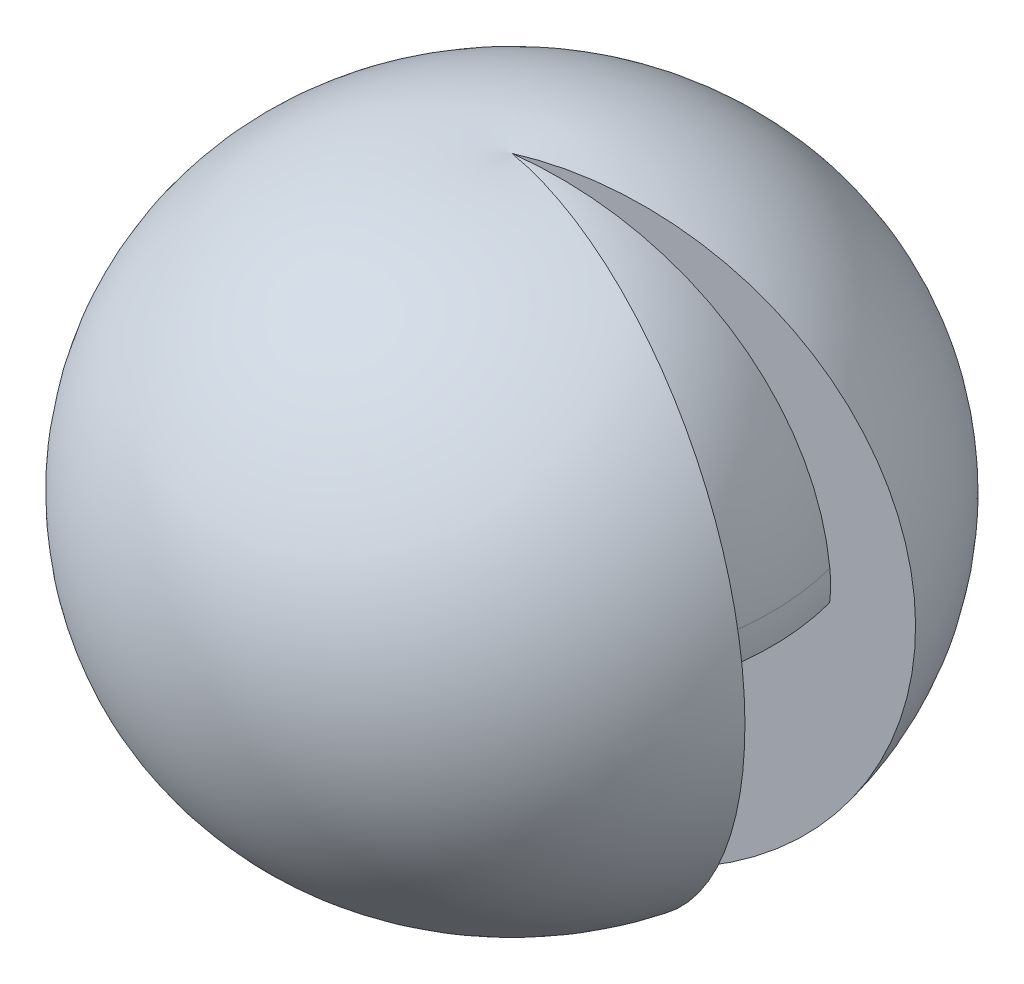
ISO-10303-21;
HEADER;
FILE_DESCRIPTION(('STEP AP214'),'2;1');
FILE_NAME('part.step','',(''),(''),'','','');
FILE_SCHEMA(('AUTOMOTIVE_DESIGN { 1 0 10303 214 1 1 1 1 }'));
ENDSEC;
DATA;
#1=APPLICATION_CONTEXT('core data for automotive mechanical design processes');
#2=APPLICATION_PROTOCOL_DEFINITION('international standard','automotive_design',2000,#1);
#3=PRODUCT_CONTEXT('',#1,'mechanical');
#4=PRODUCT('Part','Part','',(#3));
#5=PRODUCT_RELATED_PRODUCT_CATEGORY('part','',(#4));
#6=PRODUCT_DEFINITION_FORMATION('','',#4);
#7=PRODUCT_DEFINITION_CONTEXT('part definition',#1,'design');
#8=PRODUCT_DEFINITION('design','',#6,#7);
#9=PRODUCT_DEFINITION_SHAPE('','',#8);
#10=(LENGTH_UNIT() NAMED_UNIT(*) SI_UNIT(.MILLI.,.METRE.));
#11=(NAMED_UNIT(*) PLANE_ANGLE_UNIT() SI_UNIT($,.RADIAN.));
#12=(NAMED_UNIT(*) SI_UNIT($,.STERADIAN.) SOLID_ANGLE_UNIT());
#13=UNCERTAINTY_MEASURE_WITH_UNIT(LENGTH_MEASURE(1.E-05),#10,'distance_accuracy_value','');
#14=(GEOMETRIC_REPRESENTATION_CONTEXT(3) GLOBAL_UNCERTAINTY_ASSIGNED_CONTEXT((#13)) GLOBAL_UNIT_ASSIGNED_CONTEXT((#10,
#11,#12)) REPRESENTATION_CONTEXT('',''));
#15=CARTESIAN_POINT('',(0.,0.,0.));
#16=DIRECTION('',(0.,0.,1.));
#17=DIRECTION('',(1.,0.,0.));
#18=AXIS2_PLACEMENT_3D('',#15,#16,#17);
#19=CARTESIAN_POINT('',(0.,-104.721594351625,-399.344774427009));
#20=DIRECTION('',(-1.,0.,0.));
#21=DIRECTION('',(0.,0.,-1.));
#22=AXIS2_PLACEMENT_3D('',#19,#20,#21);
#23=CIRCLE('',#22,696.244210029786);
#24=TRIMMED_CURVE('',#23,(PARAMETER_VALUE(-2.18165367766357)),
(PARAMETER_VALUE(2.18165367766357)),.T.,.PARAMETER.);
#25=CARTESIAN_POINT('',(0.,-104.721594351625,0.));
#26=DIRECTION('',(0.,-1.,0.));
#27=AXIS1_PLACEMENT('',#25,#26);
#28=SURFACE_OF_REVOLUTION('',#24,#27);
#29=CARTESIAN_POINT('',(385.737431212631,-104.721594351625,-103.358033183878));
#30=DIRECTION('',(-0.258819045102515,0.,-0.96592582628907));
#31=DIRECTION('',(-0.96592582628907,0.,0.258819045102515));
#32=AXIS2_PLACEMENT_3D('',#29,#30,#31);
#33=CIRCLE('',#32,696.244210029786);
#34=CARTESIAN_POINT('',(669.956776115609,-735.733143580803,-179.514377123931));
#35=VERTEX_POINT('',#34);
#36=CARTESIAN_POINT('',(0.,-675.054612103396,0.));
#37=VERTEX_POINT('',#36);
#38=EDGE_CURVE('E143',#35,#37,#33,.T.);
#39=ORIENTED_EDGE('',*,*,#38,.T.);
#40=CARTESIAN_POINT('',(385.737431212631,-104.721594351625,103.358033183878));
#41=DIRECTION('',(0.258819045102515,0.,-0.96592582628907));
#42=DIRECTION('',(-0.96592582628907,0.,-0.258819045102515));
#43=AXIS2_PLACEMENT_3D('',#40,#41,#42);
#44=CIRCLE('',#43,696.244210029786);
#45=CARTESIAN_POINT('',(669.956776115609,-735.733143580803,179.514377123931));
#46=VERTEX_POINT('',#45);
#47=EDGE_CURVE('E148',#46,#37,#44,.T.);
#48=ORIENTED_EDGE('',*,*,#47,.F.);
#49=CARTESIAN_POINT('',(0.,-735.733143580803,0.));
#50=DIRECTION('',(0.,-1.,0.));
#51=DIRECTION('',(0.,0.,-1.));
#52=AXIS2_PLACEMENT_3D('',#49,#50,#51);
#53=CIRCLE('',#52,693.590292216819);
#54=EDGE_CURVE('E63',#46,#35,#53,.T.);
#55=ORIENTED_EDGE('',*,*,#54,.T.);
#56=EDGE_LOOP('',(#39,#48,#55));
#57=FACE_BOUND('',#56,.T.);
#58=ADVANCED_FACE('F40',(#57),#28,.T.);
#59=CARTESIAN_POINT('',(0.,61.0430833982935,109.684552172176));
#60=DIRECTION('',(-1.,0.,0.));
#61=DIRECTION('',(0.,0.,-1.));
#62=AXIS2_PLACEMENT_3D('',#59,#60,#61);
#63=CIRCLE('',#62,483.007260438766);
#64=TRIMMED_CURVE('',#63,(PARAMETER_VALUE(-1.34171108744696)),
(PARAMETER_VALUE(1.34171108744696)),.T.,.PARAMETER.);
#65=CARTESIAN_POINT('',(0.,61.0430833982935,0.));
#66=DIRECTION('',(0.,-1.,0.));
#67=AXIS1_PLACEMENT('',#65,#66);
#68=SURFACE_OF_REVOLUTION('',#64,#67);
#69=CARTESIAN_POINT('',(0.,253.742616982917,0.));
#70=DIRECTION('',(0.,-1.,0.));
#71=DIRECTION('',(0.,0.,-1.));
#72=AXIS2_PLACEMENT_3D('',#69,#70,#71);
#73=CIRCLE('',#72,333.218262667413);
#74=CARTESIAN_POINT('',(321.86412570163,253.742616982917,86.2432325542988));
#75=VERTEX_POINT('',#74);
#76=CARTESIAN_POINT('',(321.86412570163,253.742616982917,-86.2432325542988));
#77=VERTEX_POINT('',#76);
#78=EDGE_CURVE('E145',#75,#77,#73,.T.);
#79=ORIENTED_EDGE('',*,*,#78,.F.);
#80=CARTESIAN_POINT('',(-105.947141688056,61.0430833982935,-28.3884510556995));
#81=DIRECTION('',(-0.258819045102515,0.,0.96592582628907));
#82=DIRECTION('',(-0.96592582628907,0.,-0.258819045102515));
#83=AXIS2_PLACEMENT_3D('',#80,#81,#82);
#84=CIRCLE('',#83,483.007260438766);
#85=CARTESIAN_POINT('',(0.,-409.345386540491,0.));
#86=VERTEX_POINT('',#85);
#87=EDGE_CURVE('E128',#86,#75,#84,.T.);
#88=ORIENTED_EDGE('',*,*,#87,.F.);
#89=CARTESIAN_POINT('',(-105.947141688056,61.0430833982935,28.3884510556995));
#90=DIRECTION('',(0.258819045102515,0.,0.96592582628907));
#91=DIRECTION('',(-0.96592582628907,0.,0.258819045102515));
#92=AXIS2_PLACEMENT_3D('',#89,#90,#91);
#93=CIRCLE('',#92,483.007260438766);
#94=EDGE_CURVE('E136',#86,#77,#93,.T.);
#95=ORIENTED_EDGE('',*,*,#94,.T.);
#96=EDGE_LOOP('',(#79,#88,#95));
#97=FACE_BOUND('',#96,.T.);
#98=ADVANCED_FACE('F42',(#97),#68,.F.);
#99=CARTESIAN_POINT('',(0.,430.,0.));
#100=DIRECTION('',(0.,-1.,0.));
#101=DIRECTION('',(0.,0.,-1.));
#102=AXIS2_PLACEMENT_3D('',#99,#100,#101);
#103=DEGENERATE_TOROIDAL_SURFACE('',#102,150.000000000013,254.235317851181,.T.);
#104=CARTESIAN_POINT('',(0.,670.54172701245,0.));
#105=DIRECTION('',(0.,-1.,0.));
#106=DIRECTION('',(0.,0.,-1.));
#107=AXIS2_PLACEMENT_3D('',#104,#105,#106);
#108=CIRCLE('',#107,232.312055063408);
#109=CARTESIAN_POINT('',(224.396213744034,670.54172701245,60.126784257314));
#110=VERTEX_POINT('',#109);
#111=CARTESIAN_POINT('',(224.396213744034,670.54172701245,-60.126784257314));
#112=VERTEX_POINT('',#111);
#113=EDGE_CURVE('E166',#110,#112,#108,.T.);
#114=ORIENTED_EDGE('',*,*,#113,.F.);
#115=CARTESIAN_POINT('',(144.888873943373,430.,38.8228567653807));
#116=DIRECTION('',(-0.258819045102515,0.,0.96592582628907));
#117=DIRECTION('',(-0.96592582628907,0.,-0.258819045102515));
#118=AXIS2_PLACEMENT_3D('',#115,#116,#117);
#119=CIRCLE('',#118,254.235317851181);
#120=EDGE_CURVE('E147',#75,#110,#119,.T.);
#121=ORIENTED_EDGE('',*,*,#120,.F.);
#122=ORIENTED_EDGE('',*,*,#78,.T.);
#123=CARTESIAN_POINT('',(144.888873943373,430.,-38.8228567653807));
#124=DIRECTION('',(0.258819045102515,0.,0.96592582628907));
#125=DIRECTION('',(-0.96592582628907,0.,0.258819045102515));
#126=AXIS2_PLACEMENT_3D('',#123,#124,#125);
#127=CIRCLE('',#126,254.235317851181);
#128=EDGE_CURVE('E140',#77,#112,#127,.T.);
#129=ORIENTED_EDGE('',*,*,#128,.T.);
#130=EDGE_LOOP('',(#114,#121,#122,#129));
#131=FACE_BOUND('',#130,.T.);
#132=ADVANCED_FACE('F234',(#131),#103,.F.);
#133=CARTESIAN_POINT('',(0.,481.421888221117,437.75487187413));
#134=DIRECTION('',(-1.,0.,0.));
#135=DIRECTION('',(0.,0.,-1.));
#136=AXIS2_PLACEMENT_3D('',#133,#134,#135);
#137=CIRCLE('',#136,696.244210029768);
#138=TRIMMED_CURVE('',#137,(PARAMETER_VALUE(-0.89086768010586)),
(PARAMETER_VALUE(0.89086768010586)),.T.,.PARAMETER.);
#139=CARTESIAN_POINT('',(0.,481.421888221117,0.));
#140=DIRECTION('',(0.,-1.,0.));
#141=AXIS1_PLACEMENT('',#139,#140);
#142=SURFACE_OF_REVOLUTION('',#138,#141);
#143=CARTESIAN_POINT('',(-422.838736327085,481.421888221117,113.299297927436));
#144=DIRECTION('',(0.258819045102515,0.,0.96592582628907));
#145=DIRECTION('',(-0.96592582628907,0.,0.258819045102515));
#146=AXIS2_PLACEMENT_3D('',#143,#144,#145);
#147=CIRCLE('',#146,696.244210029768);
#148=CARTESIAN_POINT('',(0.,1022.83362816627,0.));
#149=VERTEX_POINT('',#148);
#150=EDGE_CURVE('E196',#112,#149,#147,.T.);
#151=ORIENTED_EDGE('',*,*,#150,.T.);
#152=CARTESIAN_POINT('',(-422.838736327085,481.421888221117,-113.299297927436));
#153=DIRECTION('',(-0.258819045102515,0.,0.96592582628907));
#154=DIRECTION('',(-0.96592582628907,0.,-0.258819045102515));
#155=AXIS2_PLACEMENT_3D('',#152,#153,#154);
#156=CIRCLE('',#155,696.244210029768);
#157=EDGE_CURVE('E152',#110,#149,#156,.T.);
#158=ORIENTED_EDGE('',*,*,#157,.F.);
#159=ORIENTED_EDGE('',*,*,#113,.T.);
#160=EDGE_LOOP('',(#151,#158,#159));
#161=FACE_BOUND('',#160,.T.);
#162=ADVANCED_FACE('F240',(#161),#142,.F.);
#163=CARTESIAN_POINT('',(0.,430.,-150.000000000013));
#164=DIRECTION('',(-1.,0.,0.));
#165=DIRECTION('',(0.,0.,-1.));
#166=AXIS2_PLACEMENT_3D('',#163,#164,#165);
#167=CIRCLE('',#166,1286.24421002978);
#168=TRIMMED_CURVE('',#167,(PARAMETER_VALUE(-1.68768089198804)),
(PARAMETER_VALUE(1.68768089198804)),.T.,.PARAMETER.);
#169=CARTESIAN_POINT('',(0.,430.,0.));
#170=DIRECTION('',(0.,-1.,0.));
#171=AXIS1_PLACEMENT('',#169,#170);
#172=SURFACE_OF_REVOLUTION('',#168,#171);
#173=CARTESIAN_POINT('',(144.888873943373,430.,38.8228567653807));
#174=DIRECTION('',(0.258819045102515,0.,-0.96592582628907));
#175=DIRECTION('',(-0.96592582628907,0.,-0.258819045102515));
#176=AXIS2_PLACEMENT_3D('',#173,#174,#175);
#177=CIRCLE('',#176,1286.24421002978);
#178=CARTESIAN_POINT('',(0.,1707.46787350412,0.));
#179=VERTEX_POINT('',#178);
#180=EDGE_CURVE('E161',#179,#46,#177,.T.);
#181=ORIENTED_EDGE('',*,*,#180,.F.);
#182=CARTESIAN_POINT('',(144.888873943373,430.,-38.8228567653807));
#183=DIRECTION('',(-0.258819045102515,0.,-0.96592582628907));
#184=DIRECTION('',(-0.96592582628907,0.,0.258819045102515));
#185=AXIS2_PLACEMENT_3D('',#182,#183,#184);
#186=CIRCLE('',#185,1286.24421002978);
#187=EDGE_CURVE('E154',#179,#35,#186,.T.);
#188=ORIENTED_EDGE('',*,*,#187,.T.);
#189=ORIENTED_EDGE('',*,*,#54,.F.);
#190=EDGE_LOOP('',(#181,#188,#189));
#191=FACE_BOUND('',#190,.T.);
#192=ADVANCED_FACE('F194',(#191),#172,.T.);
#193=CARTESIAN_POINT('',(385.737431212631,-104.721594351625,103.358033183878));
#194=DIRECTION('',(0.258819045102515,0.,-0.96592582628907));
#195=DIRECTION('',(-0.96592582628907,0.,-0.258819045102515));
#196=AXIS2_PLACEMENT_3D('',#193,#194,#195);
#197=PLANE('',#196);
#198=CARTESIAN_POINT('',(105.947141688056,61.0430833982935,28.3884510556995));
#199=DIRECTION('',(0.258819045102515,0.,-0.96592582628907));
#200=DIRECTION('',(-0.96592582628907,0.,-0.258819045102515));
#201=AXIS2_PLACEMENT_3D('',#198,#199,#200);
#202=CIRCLE('',#201,483.007260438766);
#203=CARTESIAN_POINT('',(219.94325688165,-407.324178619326,58.9336180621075));
#204=VERTEX_POINT('',#203);
#205=EDGE_CURVE('E116',#86,#204,#202,.F.);
#206=ORIENTED_EDGE('',*,*,#205,.F.);
#207=ORIENTED_EDGE('',*,*,#87,.T.);
#208=ORIENTED_EDGE('',*,*,#120,.T.);
#209=ORIENTED_EDGE('',*,*,#157,.T.);
#210=CARTESIAN_POINT('',(422.838736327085,481.421888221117,113.299297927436));
#211=DIRECTION('',(0.258819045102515,0.,-0.96592582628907));
#212=DIRECTION('',(-0.96592582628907,0.,-0.258819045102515));
#213=AXIS2_PLACEMENT_3D('',#210,#211,#212);
#214=CIRCLE('',#213,696.244210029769);
#215=CARTESIAN_POINT('',(1070.07368639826,670.541727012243,286.725380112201));
#216=VERTEX_POINT('',#215);
#217=EDGE_CURVE('E205',#216,#149,#214,.F.);
#218=ORIENTED_EDGE('',*,*,#217,.F.);
#219=CARTESIAN_POINT('',(-144.888873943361,430.,-38.8228567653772));
#220=DIRECTION('',(0.258819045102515,0.,-0.96592582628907));
#221=DIRECTION('',(-0.96592582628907,0.,-0.258819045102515));
#222=AXIS2_PLACEMENT_3D('',#219,#220,#221);
#223=CIRCLE('',#222,1280.61547702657);
#224=CARTESIAN_POINT('',(1091.96204193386,411.531105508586,292.590347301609));
#225=VERTEX_POINT('',#224);
#226=EDGE_CURVE('E208',#225,#216,#223,.F.);
#227=ORIENTED_EDGE('',*,*,#226,.F.);
#228=CARTESIAN_POINT('',(422.838736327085,481.421888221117,113.299297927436));
#229=DIRECTION('',(0.258819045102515,0.,-0.96592582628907));
#230=DIRECTION('',(-0.96592582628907,0.,-0.258819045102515));
#231=AXIS2_PLACEMENT_3D('',#228,#229,#230);
#232=CIRCLE('',#231,696.244210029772);
#233=CARTESIAN_POINT('',(1092.79985755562,542.103569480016,292.814839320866));
#234=VERTEX_POINT('',#233);
#235=EDGE_CURVE('E189',#234,#225,#232,.T.);
#236=ORIENTED_EDGE('',*,*,#235,.F.);
#237=CARTESIAN_POINT('',(-144.888873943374,430.,-38.8228567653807));
#238=DIRECTION('',(0.258819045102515,0.,-0.96592582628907));
#239=DIRECTION('',(-0.96592582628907,0.,-0.258819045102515));
#240=AXIS2_PLACEMENT_3D('',#237,#238,#239);
#241=CIRCLE('',#240,1286.24421002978);
#242=EDGE_CURVE('E193',#179,#234,#241,.T.);
#243=ORIENTED_EDGE('',*,*,#242,.F.);
#244=ORIENTED_EDGE('',*,*,#180,.T.);
#245=ORIENTED_EDGE('',*,*,#47,.T.);
#246=CARTESIAN_POINT('',(-385.737431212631,-104.721594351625,-103.358033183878));
#247=DIRECTION('',(0.258819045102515,0.,-0.96592582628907));
#248=DIRECTION('',(-0.96592582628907,0.,-0.258819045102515));
#249=AXIS2_PLACEMENT_3D('',#246,#247,#248);
#250=CIRCLE('',#249,696.244210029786);
#251=EDGE_CURVE('E131',#204,#37,#250,.T.);
#252=ORIENTED_EDGE('',*,*,#251,.F.);
#253=EDGE_LOOP('',(#206,#207,#208,#209,#218,#227,#236,#243,#244,#245,#252));
#254=FACE_BOUND('',#253,.T.);
#255=ADVANCED_FACE('F125',(#254),#197,.T.);
#256=CARTESIAN_POINT('',(385.737431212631,-104.721594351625,-103.358033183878));
#257=DIRECTION('',(-0.258819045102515,0.,-0.96592582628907));
#258=DIRECTION('',(-0.96592582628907,0.,0.258819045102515));
#259=AXIS2_PLACEMENT_3D('',#256,#257,#258);
#260=PLANE('',#259);
#261=ORIENTED_EDGE('',*,*,#94,.F.);
#262=CARTESIAN_POINT('',(105.947141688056,61.0430833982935,-28.3884510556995));
#263=DIRECTION('',(-0.258819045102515,0.,-0.96592582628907));
#264=DIRECTION('',(-0.96592582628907,0.,0.258819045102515));
#265=AXIS2_PLACEMENT_3D('',#262,#263,#264);
#266=CIRCLE('',#265,483.007260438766);
#267=CARTESIAN_POINT('',(219.94325688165,-407.324178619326,-58.9336180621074));
#268=VERTEX_POINT('',#267);
#269=EDGE_CURVE('E11',#86,#268,#266,.F.);
#270=ORIENTED_EDGE('',*,*,#269,.T.);
#271=CARTESIAN_POINT('',(-385.737431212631,-104.721594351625,103.358033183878));
#272=DIRECTION('',(-0.258819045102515,0.,-0.96592582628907));
#273=DIRECTION('',(-0.96592582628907,0.,0.258819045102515));
#274=AXIS2_PLACEMENT_3D('',#271,#272,#273);
#275=CIRCLE('',#274,696.244210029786);
#276=EDGE_CURVE('E48',#268,#37,#275,.T.);
#277=ORIENTED_EDGE('',*,*,#276,.T.);
#278=ORIENTED_EDGE('',*,*,#38,.F.);
#279=ORIENTED_EDGE('',*,*,#187,.F.);
#280=CARTESIAN_POINT('',(-144.888873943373,430.,38.8228567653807));
#281=DIRECTION('',(-0.258819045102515,0.,-0.96592582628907));
#282=DIRECTION('',(-0.96592582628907,0.,0.258819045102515));
#283=AXIS2_PLACEMENT_3D('',#280,#281,#282);
#284=CIRCLE('',#283,1286.24421002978);
#285=CARTESIAN_POINT('',(1092.79985755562,542.103569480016,-292.814839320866));
#286=VERTEX_POINT('',#285);
#287=EDGE_CURVE('E181',#179,#286,#284,.T.);
#288=ORIENTED_EDGE('',*,*,#287,.T.);
#289=CARTESIAN_POINT('',(422.838736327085,481.421888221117,-113.299297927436));
#290=DIRECTION('',(-0.258819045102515,0.,-0.96592582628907));
#291=DIRECTION('',(-0.96592582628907,0.,0.258819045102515));
#292=AXIS2_PLACEMENT_3D('',#289,#290,#291);
#293=CIRCLE('',#292,696.244210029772);
#294=CARTESIAN_POINT('',(1091.96204193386,411.531105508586,-292.590347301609));
#295=VERTEX_POINT('',#294);
#296=EDGE_CURVE('E178',#286,#295,#293,.T.);
#297=ORIENTED_EDGE('',*,*,#296,.T.);
#298=CARTESIAN_POINT('',(-144.888873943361,430.,38.8228567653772));
#299=DIRECTION('',(-0.258819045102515,0.,-0.96592582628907));
#300=DIRECTION('',(-0.96592582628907,0.,0.258819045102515));
#301=AXIS2_PLACEMENT_3D('',#298,#299,#300);
#302=CIRCLE('',#301,1280.61547702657);
#303=CARTESIAN_POINT('',(1070.07368639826,670.541727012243,-286.725380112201));
#304=VERTEX_POINT('',#303);
#305=EDGE_CURVE('E170',#295,#304,#302,.F.);
#306=ORIENTED_EDGE('',*,*,#305,.T.);
#307=CARTESIAN_POINT('',(422.838736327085,481.421888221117,-113.299297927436));
#308=DIRECTION('',(-0.258819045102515,0.,-0.96592582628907));
#309=DIRECTION('',(-0.96592582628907,0.,0.258819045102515));
#310=AXIS2_PLACEMENT_3D('',#307,#308,#309);
#311=CIRCLE('',#310,696.244210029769);
#312=EDGE_CURVE('E174',#304,#149,#311,.F.);
#313=ORIENTED_EDGE('',*,*,#312,.T.);
#314=ORIENTED_EDGE('',*,*,#150,.F.);
#315=ORIENTED_EDGE('',*,*,#128,.F.);
#316=EDGE_LOOP('',(#261,#270,#277,#278,#279,#288,#297,#306,#313,#314,#315));
#317=FACE_BOUND('',#316,.T.);
#318=ADVANCED_FACE('F137',(#317),#260,.F.);
#319=CARTESIAN_POINT('',(0.,481.421888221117,0.));
#320=DIRECTION('',(0.,-1.,0.));
#321=DIRECTION('',(0.,0.,-1.));
#322=AXIS2_PLACEMENT_3D('',#319,#320,#321);
#323=DEGENERATE_TOROIDAL_SURFACE('',#322,437.75487187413,696.244210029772,.T.);
#324=CARTESIAN_POINT('',(0.,542.103569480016,0.));
#325=DIRECTION('',(0.,-1.,0.));
#326=DIRECTION('',(0.,0.,-1.));
#327=AXIS2_PLACEMENT_3D('',#324,#325,#326);
#328=CIRCLE('',#327,1131.34966248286);
#329=EDGE_CURVE('E210',#286,#234,#328,.T.);
#330=ORIENTED_EDGE('',*,*,#329,.T.);
#331=ORIENTED_EDGE('',*,*,#235,.T.);
#332=CARTESIAN_POINT('',(0.,411.531105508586,0.));
#333=DIRECTION('',(0.,-1.,0.));
#334=DIRECTION('',(0.,0.,-1.));
#335=AXIS2_PLACEMENT_3D('',#332,#333,#334);
#336=CIRCLE('',#335,1130.48229192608);
#337=EDGE_CURVE('E132',#295,#225,#336,.T.);
#338=ORIENTED_EDGE('',*,*,#337,.F.);
#339=ORIENTED_EDGE('',*,*,#296,.F.);
#340=EDGE_LOOP('',(#330,#331,#338,#339));
#341=FACE_BOUND('',#340,.T.);
#342=ADVANCED_FACE('F254',(#341),#323,.T.);
#343=CARTESIAN_POINT('',(0.,430.,150.000000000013));
#344=DIRECTION('',(-1.,0.,0.));
#345=DIRECTION('',(0.,0.,-1.));
#346=AXIS2_PLACEMENT_3D('',#343,#344,#345);
#347=CIRCLE('',#346,1286.24421002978);
#348=TRIMMED_CURVE('',#347,(PARAMETER_VALUE(-1.45391176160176)),
(PARAMETER_VALUE(1.45391176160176)),.T.,.PARAMETER.);
#349=CARTESIAN_POINT('',(0.,430.,0.));
#350=DIRECTION('',(0.,-1.,0.));
#351=AXIS1_PLACEMENT('',#349,#350);
#352=SURFACE_OF_REVOLUTION('',#348,#351);
#353=ORIENTED_EDGE('',*,*,#287,.F.);
#354=ORIENTED_EDGE('',*,*,#242,.T.);
#355=ORIENTED_EDGE('',*,*,#329,.F.);
#356=EDGE_LOOP('',(#353,#354,#355));
#357=FACE_BOUND('',#356,.T.);
#358=ADVANCED_FACE('F257',(#357),#352,.T.);
#359=CARTESIAN_POINT('',(0.,481.421888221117,-437.75487187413));
#360=DIRECTION('',(-1.,0.,0.));
#361=DIRECTION('',(0.,0.,-1.));
#362=AXIS2_PLACEMENT_3D('',#359,#360,#361);
#363=CIRCLE('',#362,696.244210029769);
#364=TRIMMED_CURVE('',#363,(PARAMETER_VALUE(-2.25072497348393)),
(PARAMETER_VALUE(2.25072497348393)),.T.,.PARAMETER.);
#365=CARTESIAN_POINT('',(0.,481.421888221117,0.));
#366=DIRECTION('',(0.,-1.,0.));
#367=AXIS1_PLACEMENT('',#365,#366);
#368=SURFACE_OF_REVOLUTION('',#364,#367);
#369=CARTESIAN_POINT('',(0.,670.541727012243,0.));
#370=DIRECTION('',(0.,-1.,0.));
#371=DIRECTION('',(0.,0.,-1.));
#372=AXIS2_PLACEMENT_3D('',#369,#370,#371);
#373=CIRCLE('',#372,1107.82179881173);
#374=EDGE_CURVE('E55',#304,#216,#373,.T.);
#375=ORIENTED_EDGE('',*,*,#374,.T.);
#376=ORIENTED_EDGE('',*,*,#217,.T.);
#377=ORIENTED_EDGE('',*,*,#312,.F.);
#378=EDGE_LOOP('',(#375,#376,#377));
#379=FACE_BOUND('',#378,.T.);
#380=ADVANCED_FACE('F250',(#379),#368,.F.);
#381=CARTESIAN_POINT('',(0.,430.,0.));
#382=DIRECTION('',(0.,-1.,0.));
#383=DIRECTION('',(0.,0.,-1.));
#384=AXIS2_PLACEMENT_3D('',#381,#382,#383);
#385=DEGENERATE_TOROIDAL_SURFACE('',#384,150.,1280.61547702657,.F.);
#386=ORIENTED_EDGE('',*,*,#337,.T.);
#387=ORIENTED_EDGE('',*,*,#226,.T.);
#388=ORIENTED_EDGE('',*,*,#374,.F.);
#389=ORIENTED_EDGE('',*,*,#305,.F.);
#390=EDGE_LOOP('',(#386,#387,#388,#389));
#391=FACE_BOUND('',#390,.T.);
#392=ADVANCED_FACE('F226',(#391),#385,.T.);
#393=CARTESIAN_POINT('',(0.,61.0430833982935,-109.684552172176));
#394=DIRECTION('',(-1.,0.,0.));
#395=DIRECTION('',(0.,0.,-1.));
#396=AXIS2_PLACEMENT_3D('',#393,#394,#395);
#397=CIRCLE('',#396,483.007260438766);
#398=TRIMMED_CURVE('',#397,(PARAMETER_VALUE(-1.79988156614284)),
(PARAMETER_VALUE(1.79988156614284)),.T.,.PARAMETER.);
#399=CARTESIAN_POINT('',(0.,61.0430833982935,0.));
#400=DIRECTION('',(0.,-1.,0.));
#401=AXIS1_PLACEMENT('',#399,#400);
#402=SURFACE_OF_REVOLUTION('',#398,#401);
#403=ORIENTED_EDGE('',*,*,#269,.F.);
#404=ORIENTED_EDGE('',*,*,#205,.T.);
#405=CARTESIAN_POINT('',(0.,-407.324178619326,0.));
#406=DIRECTION('',(0.,-1.,0.));
#407=DIRECTION('',(0.,0.,-1.));
#408=AXIS2_PLACEMENT_3D('',#405,#406,#407);
#409=CIRCLE('',#408,227.702014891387);
#410=EDGE_CURVE('E118',#268,#204,#409,.T.);
#411=ORIENTED_EDGE('',*,*,#410,.F.);
#412=EDGE_LOOP('',(#403,#404,#411));
#413=FACE_BOUND('',#412,.T.);
#414=ADVANCED_FACE('F115',(#413),#402,.F.);
#415=CARTESIAN_POINT('',(0.,-104.721594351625,399.344774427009));
#416=DIRECTION('',(-1.,0.,0.));
#417=DIRECTION('',(0.,0.,-1.));
#418=AXIS2_PLACEMENT_3D('',#415,#416,#417);
#419=CIRCLE('',#418,696.244210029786);
#420=TRIMMED_CURVE('',#419,(PARAMETER_VALUE(-0.959938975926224)),
(PARAMETER_VALUE(0.959938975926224)),.T.,.PARAMETER.);
#421=CARTESIAN_POINT('',(0.,-104.721594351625,0.));
#422=DIRECTION('',(0.,-1.,0.));
#423=AXIS1_PLACEMENT('',#421,#422);
#424=SURFACE_OF_REVOLUTION('',#420,#423);
#425=ORIENTED_EDGE('',*,*,#410,.T.);
#426=ORIENTED_EDGE('',*,*,#251,.T.);
#427=ORIENTED_EDGE('',*,*,#276,.F.);
#428=EDGE_LOOP('',(#425,#426,#427));
#429=FACE_BOUND('',#428,.T.);
#430=ADVANCED_FACE('F220',(#429),#424,.T.);
#431=CLOSED_SHELL('',(#58,#98,#132,#162,#192,#255,#318,#342,#358,#380,#392,#414,#430));
#432=MANIFOLD_SOLID_BREP('B2',#431);
#433=ADVANCED_BREP_SHAPE_REPRESENTATION('',(#18,#432),#14);
#434=SHAPE_DEFINITION_REPRESENTATION(#9,#433);
ENDSEC;
END-ISO-10303-21;
